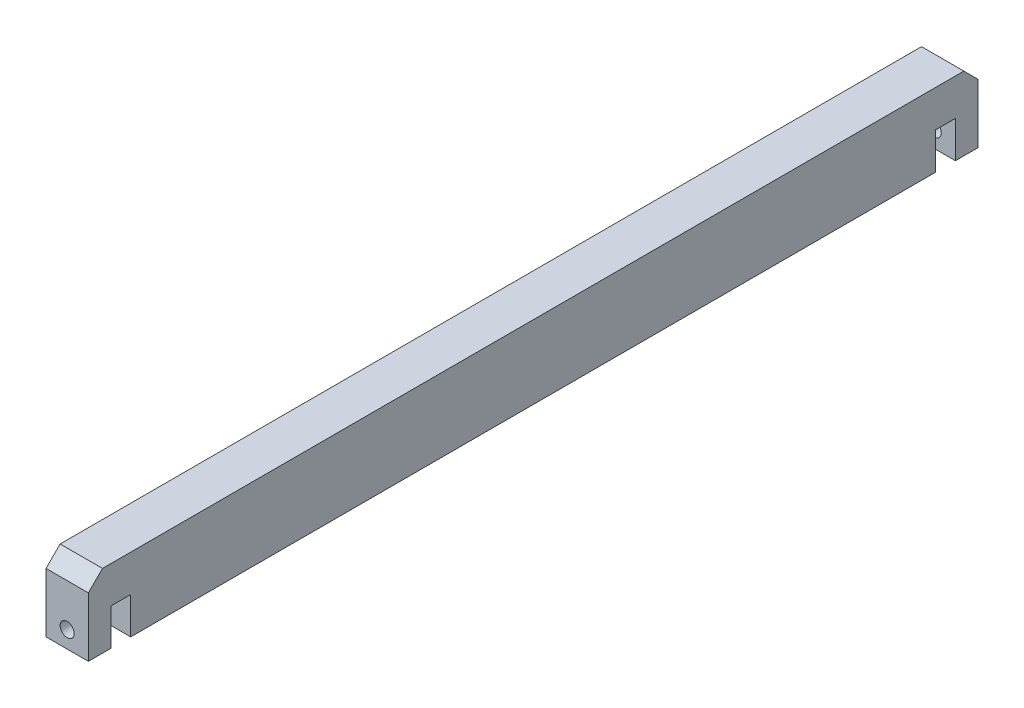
from build123d import *

# Parameters (mm, degrees)
ESQUISSE1_W             = 15
ESQUISSE1_H             = 26
BOSS_EXTRU_1_DEPTH      = 157.5
ESQUISSE2_W             = 7
ESQUISSE2_H             = 22.316051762
ENL_V_MAT_EXTRU_1_DEPTH = 161.334805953
TROU_TARAUD_M61_REACH   = 318.427
TROU_TARAUD_M61_BORE_R  = 2.5
CHANFREIN1_SIZE         = 5


with BuildPart() as part:
    # Esquisse1 → Boss.-Extru.1 (new, symmetric)
    with BuildSketch(Plane.XY):
        with Locations((7.5, 13)):
            Rectangle(ESQUISSE1_W, ESQUISSE1_H)
    extrude(amount=BOSS_EXTRU_1_DEPTH, both=True)

    # Esquisse2 → Enl_v. mat.-Extru.1 (cut, through all)
    with BuildSketch(Plane(origin=(15, 0, 0), x_dir=(0, 0, -1), z_dir=(1, 0, 0))):
        with Locations((-146, 1.841974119)):
            Rectangle(ESQUISSE2_W, ESQUISSE2_H)
    enl_v_mat_extru_1 = extrude(amount=-ENL_V_MAT_EXTRU_1_DEPTH, mode=Mode.SUBTRACT)

    # Trou taraud_ M61 bore → Trou taraud_ M61 (cut, up to next)
    with BuildSketch(Plane.XY.offset(157.5), mode=Mode.PRIVATE) as trou_taraud_m61_sk1:
        with Locations((7.5, 6)):
            Circle(TROU_TARAUD_M61_BORE_R)
    trou_taraud_m61_tool1 = extrude(trou_taraud_m61_sk1.sketch, amount=-TROU_TARAUD_M61_REACH, mode=Mode.PRIVATE) & part.part
    trou_taraud_m61 = trou_taraud_m61_tool1.solids().sort_by_distance((7.5, 6, 157.5))[0]
    add(trou_taraud_m61, mode=Mode.SUBTRACT)

    # Chanfrein1
    chanfrein1_edges = [part.edges().sort_by_distance(p)[0] for p in [
        (7.5, 26, 157.5),
        (7.5, 26, -157.5),
    ]]
    chamfer(chanfrein1_edges, length=CHANFREIN1_SIZE)

    # Sym_trie3: Enl_v. mat.-Extru.1, Trou taraud_ M61 across plane
    add(enl_v_mat_extru_1.mirror(Plane.XY), mode=Mode.SUBTRACT)
    add(trou_taraud_m61.mirror(Plane.XY), mode=Mode.SUBTRACT)


solid = part.part
